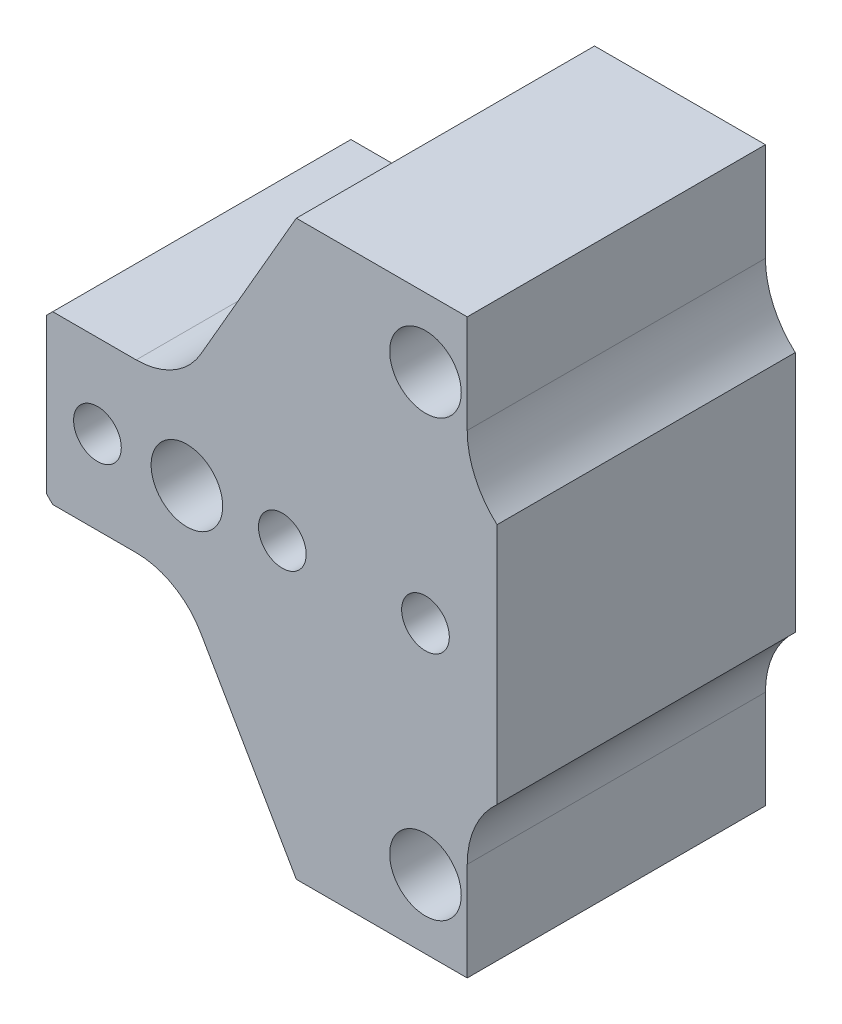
ISO-10303-21;
HEADER;
FILE_DESCRIPTION(('STEP AP214'),'2;1');
FILE_NAME('part.step','',(''),(''),'','','');
FILE_SCHEMA(('AUTOMOTIVE_DESIGN { 1 0 10303 214 1 1 1 1 }'));
ENDSEC;
DATA;
#1=APPLICATION_CONTEXT('core data for automotive mechanical design processes');
#2=APPLICATION_PROTOCOL_DEFINITION('international standard','automotive_design',2000,#1);
#3=PRODUCT_CONTEXT('',#1,'mechanical');
#4=PRODUCT('Part','Part','',(#3));
#5=PRODUCT_RELATED_PRODUCT_CATEGORY('part','',(#4));
#6=PRODUCT_DEFINITION_FORMATION('','',#4);
#7=PRODUCT_DEFINITION_CONTEXT('part definition',#1,'design');
#8=PRODUCT_DEFINITION('design','',#6,#7);
#9=PRODUCT_DEFINITION_SHAPE('','',#8);
#10=(LENGTH_UNIT() NAMED_UNIT(*) SI_UNIT(.MILLI.,.METRE.));
#11=(NAMED_UNIT(*) PLANE_ANGLE_UNIT() SI_UNIT($,.RADIAN.));
#12=(NAMED_UNIT(*) SI_UNIT($,.STERADIAN.) SOLID_ANGLE_UNIT());
#13=UNCERTAINTY_MEASURE_WITH_UNIT(LENGTH_MEASURE(1.E-05),#10,'distance_accuracy_value','');
#14=(GEOMETRIC_REPRESENTATION_CONTEXT(3) GLOBAL_UNCERTAINTY_ASSIGNED_CONTEXT((#13)) GLOBAL_UNIT_ASSIGNED_CONTEXT((#10,
#11,#12)) REPRESENTATION_CONTEXT('',''));
#15=CARTESIAN_POINT('',(0.,0.,0.));
#16=DIRECTION('',(0.,0.,1.));
#17=DIRECTION('',(1.,0.,0.));
#18=AXIS2_PLACEMENT_3D('',#15,#16,#17);
#19=CARTESIAN_POINT('',(-8.5,-26.5,50.));
#20=DIRECTION('',(0.,0.,1.));
#21=DIRECTION('',(1.,0.,0.));
#22=AXIS2_PLACEMENT_3D('',#19,#20,#21);
#23=PLANE('',#22);
#24=CARTESIAN_POINT('',(40.,36.5,50.));
#25=DIRECTION('',(0.,0.,1.));
#26=DIRECTION('',(1.,0.,0.));
#27=AXIS2_PLACEMENT_3D('',#24,#25,#26);
#28=CIRCLE('',#27,6.00000000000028);
#29=CARTESIAN_POINT('',(46.0000000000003,36.5,50.));
#30=VERTEX_POINT('',#29);
#31=EDGE_CURVE('E337',#30,#30,#28,.T.);
#32=ORIENTED_EDGE('',*,*,#31,.F.);
#33=EDGE_LOOP('',(#32));
#34=FACE_BOUND('',#33,.T.);
#35=CARTESIAN_POINT('',(-15.,0.,50.));
#36=DIRECTION('',(0.,0.,1.));
#37=DIRECTION('',(1.,0.,0.));
#38=AXIS2_PLACEMENT_3D('',#35,#36,#37);
#39=CIRCLE('',#38,4.);
#40=CARTESIAN_POINT('',(-11.,0.,50.));
#41=VERTEX_POINT('',#40);
#42=EDGE_CURVE('E349',#41,#41,#39,.T.);
#43=ORIENTED_EDGE('',*,*,#42,.F.);
#44=EDGE_LOOP('',(#43));
#45=FACE_BOUND('',#44,.T.);
#46=CARTESIAN_POINT('',(16.,0.,50.));
#47=DIRECTION('',(0.,0.,1.));
#48=DIRECTION('',(1.,0.,0.));
#49=AXIS2_PLACEMENT_3D('',#46,#47,#48);
#50=CIRCLE('',#49,4.);
#51=CARTESIAN_POINT('',(20.,0.,50.));
#52=VERTEX_POINT('',#51);
#53=EDGE_CURVE('E163',#52,#52,#50,.T.);
#54=ORIENTED_EDGE('',*,*,#53,.F.);
#55=EDGE_LOOP('',(#54));
#56=FACE_BOUND('',#55,.T.);
#57=DIRECTION('',(0.707106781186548,-0.707106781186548,0.));
#58=VECTOR('',#57,1.);
#59=CARTESIAN_POINT('',(-23.5,-13.,50.));
#60=LINE('',#59,#58);
#61=CARTESIAN_POINT('',(-23.5,-13.,50.));
#62=VERTEX_POINT('',#61);
#63=CARTESIAN_POINT('',(-22.5,-14.,50.));
#64=VERTEX_POINT('',#63);
#65=EDGE_CURVE('E190',#62,#64,#60,.T.);
#66=ORIENTED_EDGE('',*,*,#65,.T.);
#67=DIRECTION('',(1.,0.,0.));
#68=VECTOR('',#67,1.);
#69=CARTESIAN_POINT('',(-8.5,-14.,50.));
#70=LINE('',#69,#68);
#71=CARTESIAN_POINT('',(-8.5,-14.,50.));
#72=VERTEX_POINT('',#71);
#73=EDGE_CURVE('E98',#64,#72,#70,.T.);
#74=ORIENTED_EDGE('',*,*,#73,.T.);
#75=CARTESIAN_POINT('',(-8.5,-26.5,50.));
#76=DIRECTION('',(0.,0.,-1.));
#77=DIRECTION('',(1.,0.,0.));
#78=AXIS2_PLACEMENT_3D('',#75,#76,#77);
#79=CIRCLE('',#78,12.5);
#80=CARTESIAN_POINT('',(2.32531754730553,-20.25,50.));
#81=VERTEX_POINT('',#80);
#82=EDGE_CURVE('E229',#72,#81,#79,.T.);
#83=ORIENTED_EDGE('',*,*,#82,.T.);
#84=DIRECTION('',(0.5,-0.866025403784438,0.));
#85=VECTOR('',#84,1.);
#86=CARTESIAN_POINT('',(18.3467875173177,-48.,50.));
#87=LINE('',#86,#85);
#88=CARTESIAN_POINT('',(18.3467875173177,-48.,50.));
#89=VERTEX_POINT('',#88);
#90=EDGE_CURVE('E248',#81,#89,#87,.T.);
#91=ORIENTED_EDGE('',*,*,#90,.T.);
#92=DIRECTION('',(1.,0.,0.));
#93=VECTOR('',#92,1.);
#94=CARTESIAN_POINT('',(47.,-48.,50.));
#95=LINE('',#94,#93);
#96=CARTESIAN_POINT('',(47.,-48.,50.));
#97=VERTEX_POINT('',#96);
#98=EDGE_CURVE('E245',#89,#97,#95,.T.);
#99=ORIENTED_EDGE('',*,*,#98,.T.);
#100=DIRECTION('',(0.,1.,0.));
#101=VECTOR('',#100,1.);
#102=CARTESIAN_POINT('',(47.,-31.5,50.));
#103=LINE('',#102,#101);
#104=CARTESIAN_POINT('',(47.,-31.5,50.));
#105=VERTEX_POINT('',#104);
#106=EDGE_CURVE('E247',#97,#105,#103,.T.);
#107=ORIENTED_EDGE('',*,*,#106,.T.);
#108=CARTESIAN_POINT('',(62.,-31.5,50.));
#109=DIRECTION('',(0.,0.,-1.));
#110=DIRECTION('',(1.,0.,0.));
#111=AXIS2_PLACEMENT_3D('',#108,#109,#110);
#112=CIRCLE('',#111,15.);
#113=CARTESIAN_POINT('',(52.,-20.3196601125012,50.));
#114=VERTEX_POINT('',#113);
#115=EDGE_CURVE('E250',#105,#114,#112,.T.);
#116=ORIENTED_EDGE('',*,*,#115,.T.);
#117=DIRECTION('',(0.,1.,0.));
#118=VECTOR('',#117,1.);
#119=CARTESIAN_POINT('',(52.,20.3196601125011,50.));
#120=LINE('',#119,#118);
#121=CARTESIAN_POINT('',(52.,20.3196601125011,50.));
#122=VERTEX_POINT('',#121);
#123=EDGE_CURVE('E256',#114,#122,#120,.T.);
#124=ORIENTED_EDGE('',*,*,#123,.T.);
#125=CARTESIAN_POINT('',(62.,31.5,50.));
#126=DIRECTION('',(0.,0.,-1.));
#127=DIRECTION('',(1.,0.,0.));
#128=AXIS2_PLACEMENT_3D('',#125,#126,#127);
#129=CIRCLE('',#128,15.);
#130=CARTESIAN_POINT('',(47.,31.5,50.));
#131=VERTEX_POINT('',#130);
#132=EDGE_CURVE('E258',#122,#131,#129,.T.);
#133=ORIENTED_EDGE('',*,*,#132,.T.);
#134=DIRECTION('',(0.,1.,0.));
#135=VECTOR('',#134,1.);
#136=CARTESIAN_POINT('',(47.,48.,50.));
#137=LINE('',#136,#135);
#138=CARTESIAN_POINT('',(47.,48.,50.));
#139=VERTEX_POINT('',#138);
#140=EDGE_CURVE('E260',#131,#139,#137,.T.);
#141=ORIENTED_EDGE('',*,*,#140,.T.);
#142=DIRECTION('',(-1.,0.,0.));
#143=VECTOR('',#142,1.);
#144=CARTESIAN_POINT('',(18.3467875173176,48.,50.));
#145=LINE('',#144,#143);
#146=CARTESIAN_POINT('',(18.3467875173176,48.,50.));
#147=VERTEX_POINT('',#146);
#148=EDGE_CURVE('E262',#139,#147,#145,.T.);
#149=ORIENTED_EDGE('',*,*,#148,.T.);
#150=DIRECTION('',(-0.5,-0.866025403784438,0.));
#151=VECTOR('',#150,1.);
#152=CARTESIAN_POINT('',(2.32531754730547,20.25,50.));
#153=LINE('',#152,#151);
#154=CARTESIAN_POINT('',(2.32531754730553,20.25,50.));
#155=VERTEX_POINT('',#154);
#156=EDGE_CURVE('E264',#147,#155,#153,.T.);
#157=ORIENTED_EDGE('',*,*,#156,.T.);
#158=CARTESIAN_POINT('',(-8.5,26.5,50.));
#159=DIRECTION('',(0.,0.,-1.));
#160=DIRECTION('',(1.,0.,0.));
#161=AXIS2_PLACEMENT_3D('',#158,#159,#160);
#162=CIRCLE('',#161,12.5);
#163=CARTESIAN_POINT('',(-8.5,14.,50.));
#164=VERTEX_POINT('',#163);
#165=EDGE_CURVE('E141',#155,#164,#162,.T.);
#166=ORIENTED_EDGE('',*,*,#165,.T.);
#167=DIRECTION('',(-1.,0.,0.));
#168=VECTOR('',#167,1.);
#169=CARTESIAN_POINT('',(-22.5,14.,50.));
#170=LINE('',#169,#168);
#171=CARTESIAN_POINT('',(-22.5,14.,50.));
#172=VERTEX_POINT('',#171);
#173=EDGE_CURVE('E135',#164,#172,#170,.T.);
#174=ORIENTED_EDGE('',*,*,#173,.T.);
#175=DIRECTION('',(-0.707106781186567,-0.707106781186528,0.));
#176=VECTOR('',#175,1.);
#177=CARTESIAN_POINT('',(-22.5,14.,50.));
#178=LINE('',#177,#176);
#179=CARTESIAN_POINT('',(-23.5,13.,50.));
#180=VERTEX_POINT('',#179);
#181=EDGE_CURVE('E139',#172,#180,#178,.T.);
#182=ORIENTED_EDGE('',*,*,#181,.T.);
#183=DIRECTION('',(0.,-1.,0.));
#184=VECTOR('',#183,1.);
#185=CARTESIAN_POINT('',(-23.5,-13.,50.));
#186=LINE('',#185,#184);
#187=EDGE_CURVE('E31',#180,#62,#186,.T.);
#188=ORIENTED_EDGE('',*,*,#187,.T.);
#189=EDGE_LOOP('',(#66,#74,#83,#91,#99,#107,#116,#124,#133,#141,#149,#157,#166,#174,#182,#188));
#190=FACE_BOUND('',#189,.T.);
#191=CARTESIAN_POINT('',(40.,0.,50.));
#192=DIRECTION('',(0.,0.,1.));
#193=DIRECTION('',(1.,0.,0.));
#194=AXIS2_PLACEMENT_3D('',#191,#192,#193);
#195=CIRCLE('',#194,4.);
#196=CARTESIAN_POINT('',(44.,0.,50.));
#197=VERTEX_POINT('',#196);
#198=EDGE_CURVE('E355',#197,#197,#195,.T.);
#199=ORIENTED_EDGE('',*,*,#198,.F.);
#200=EDGE_LOOP('',(#199));
#201=FACE_BOUND('',#200,.T.);
#202=CARTESIAN_POINT('',(0.,0.,50.));
#203=DIRECTION('',(0.,0.,1.));
#204=DIRECTION('',(1.,0.,0.));
#205=AXIS2_PLACEMENT_3D('',#202,#203,#204);
#206=CIRCLE('',#205,6.00000000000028);
#207=CARTESIAN_POINT('',(6.00000000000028,0.,50.));
#208=VERTEX_POINT('',#207);
#209=EDGE_CURVE('E343',#208,#208,#206,.T.);
#210=ORIENTED_EDGE('',*,*,#209,.F.);
#211=EDGE_LOOP('',(#210));
#212=FACE_BOUND('',#211,.T.);
#213=CARTESIAN_POINT('',(40.,-36.5,50.));
#214=DIRECTION('',(0.,0.,1.));
#215=DIRECTION('',(1.,0.,0.));
#216=AXIS2_PLACEMENT_3D('',#213,#214,#215);
#217=CIRCLE('',#216,6.00000000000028);
#218=CARTESIAN_POINT('',(46.0000000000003,-36.5,50.));
#219=VERTEX_POINT('',#218);
#220=EDGE_CURVE('E328',#219,#219,#217,.T.);
#221=ORIENTED_EDGE('',*,*,#220,.F.);
#222=EDGE_LOOP('',(#221));
#223=FACE_BOUND('',#222,.T.);
#224=ADVANCED_FACE('F14',(#34,#45,#56,#190,#201,#212,#223),#23,.T.);
#225=CARTESIAN_POINT('',(-8.5,-26.5,0.));
#226=DIRECTION('',(0.,0.,1.));
#227=DIRECTION('',(1.,0.,0.));
#228=AXIS2_PLACEMENT_3D('',#225,#226,#227);
#229=PLANE('',#228);
#230=CARTESIAN_POINT('',(40.,36.5,0.));
#231=DIRECTION('',(0.,0.,1.));
#232=DIRECTION('',(1.,0.,0.));
#233=AXIS2_PLACEMENT_3D('',#230,#231,#232);
#234=CIRCLE('',#233,6.00000000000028);
#235=CARTESIAN_POINT('',(46.0000000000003,36.5,0.));
#236=VERTEX_POINT('',#235);
#237=EDGE_CURVE('E334',#236,#236,#234,.T.);
#238=ORIENTED_EDGE('',*,*,#237,.T.);
#239=EDGE_LOOP('',(#238));
#240=FACE_BOUND('',#239,.T.);
#241=CARTESIAN_POINT('',(-15.,0.,0.));
#242=DIRECTION('',(0.,0.,1.));
#243=DIRECTION('',(1.,0.,0.));
#244=AXIS2_PLACEMENT_3D('',#241,#242,#243);
#245=CIRCLE('',#244,4.);
#246=CARTESIAN_POINT('',(-11.,0.,0.));
#247=VERTEX_POINT('',#246);
#248=EDGE_CURVE('E346',#247,#247,#245,.T.);
#249=ORIENTED_EDGE('',*,*,#248,.T.);
#250=EDGE_LOOP('',(#249));
#251=FACE_BOUND('',#250,.T.);
#252=CARTESIAN_POINT('',(16.,0.,0.));
#253=DIRECTION('',(0.,0.,1.));
#254=DIRECTION('',(1.,0.,0.));
#255=AXIS2_PLACEMENT_3D('',#252,#253,#254);
#256=CIRCLE('',#255,4.);
#257=CARTESIAN_POINT('',(20.,0.,0.));
#258=VERTEX_POINT('',#257);
#259=EDGE_CURVE('E358',#258,#258,#256,.T.);
#260=ORIENTED_EDGE('',*,*,#259,.T.);
#261=EDGE_LOOP('',(#260));
#262=FACE_BOUND('',#261,.T.);
#263=DIRECTION('',(0.707106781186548,-0.707106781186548,0.));
#264=VECTOR('',#263,1.);
#265=CARTESIAN_POINT('',(-23.5,-13.,0.));
#266=LINE('',#265,#264);
#267=CARTESIAN_POINT('',(-23.5,-13.,0.));
#268=VERTEX_POINT('',#267);
#269=CARTESIAN_POINT('',(-22.5,-14.,0.));
#270=VERTEX_POINT('',#269);
#271=EDGE_CURVE('E159',#268,#270,#266,.T.);
#272=ORIENTED_EDGE('',*,*,#271,.F.);
#273=DIRECTION('',(0.,-1.,0.));
#274=VECTOR('',#273,1.);
#275=CARTESIAN_POINT('',(-23.5,-13.,0.));
#276=LINE('',#275,#274);
#277=CARTESIAN_POINT('',(-23.5,13.,0.));
#278=VERTEX_POINT('',#277);
#279=EDGE_CURVE('E90',#278,#268,#276,.T.);
#280=ORIENTED_EDGE('',*,*,#279,.F.);
#281=DIRECTION('',(-0.707106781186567,-0.707106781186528,0.));
#282=VECTOR('',#281,1.);
#283=CARTESIAN_POINT('',(-22.5,14.,0.));
#284=LINE('',#283,#282);
#285=CARTESIAN_POINT('',(-22.5,14.,0.));
#286=VERTEX_POINT('',#285);
#287=EDGE_CURVE('E84',#286,#278,#284,.T.);
#288=ORIENTED_EDGE('',*,*,#287,.F.);
#289=DIRECTION('',(-1.,0.,0.));
#290=VECTOR('',#289,1.);
#291=CARTESIAN_POINT('',(-22.5,14.,0.));
#292=LINE('',#291,#290);
#293=CARTESIAN_POINT('',(-8.5,14.,0.));
#294=VERTEX_POINT('',#293);
#295=EDGE_CURVE('E149',#294,#286,#292,.T.);
#296=ORIENTED_EDGE('',*,*,#295,.F.);
#297=CARTESIAN_POINT('',(-8.5,26.5,0.));
#298=DIRECTION('',(0.,0.,-1.));
#299=DIRECTION('',(1.,0.,0.));
#300=AXIS2_PLACEMENT_3D('',#297,#298,#299);
#301=CIRCLE('',#300,12.5);
#302=CARTESIAN_POINT('',(2.32531754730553,20.25,0.));
#303=VERTEX_POINT('',#302);
#304=EDGE_CURVE('E185',#303,#294,#301,.T.);
#305=ORIENTED_EDGE('',*,*,#304,.F.);
#306=DIRECTION('',(-0.5,-0.866025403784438,0.));
#307=VECTOR('',#306,1.);
#308=CARTESIAN_POINT('',(2.32531754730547,20.25,0.));
#309=LINE('',#308,#307);
#310=CARTESIAN_POINT('',(18.3467875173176,48.,0.));
#311=VERTEX_POINT('',#310);
#312=EDGE_CURVE('E183',#311,#303,#309,.T.);
#313=ORIENTED_EDGE('',*,*,#312,.F.);
#314=DIRECTION('',(-1.,0.,0.));
#315=VECTOR('',#314,1.);
#316=CARTESIAN_POINT('',(18.3467875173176,48.,0.));
#317=LINE('',#316,#315);
#318=CARTESIAN_POINT('',(47.,48.,0.));
#319=VERTEX_POINT('',#318);
#320=EDGE_CURVE('E181',#319,#311,#317,.T.);
#321=ORIENTED_EDGE('',*,*,#320,.F.);
#322=DIRECTION('',(0.,1.,0.));
#323=VECTOR('',#322,1.);
#324=CARTESIAN_POINT('',(47.,48.,0.));
#325=LINE('',#324,#323);
#326=CARTESIAN_POINT('',(47.,31.5,0.));
#327=VERTEX_POINT('',#326);
#328=EDGE_CURVE('E179',#327,#319,#325,.T.);
#329=ORIENTED_EDGE('',*,*,#328,.F.);
#330=CARTESIAN_POINT('',(62.,31.5,0.));
#331=DIRECTION('',(0.,0.,-1.));
#332=DIRECTION('',(1.,0.,0.));
#333=AXIS2_PLACEMENT_3D('',#330,#331,#332);
#334=CIRCLE('',#333,15.);
#335=CARTESIAN_POINT('',(52.,20.3196601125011,0.));
#336=VERTEX_POINT('',#335);
#337=EDGE_CURVE('E177',#336,#327,#334,.T.);
#338=ORIENTED_EDGE('',*,*,#337,.F.);
#339=DIRECTION('',(0.,1.,0.));
#340=VECTOR('',#339,1.);
#341=CARTESIAN_POINT('',(52.,20.3196601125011,0.));
#342=LINE('',#341,#340);
#343=CARTESIAN_POINT('',(52.,-20.3196601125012,0.));
#344=VERTEX_POINT('',#343);
#345=EDGE_CURVE('E175',#344,#336,#342,.T.);
#346=ORIENTED_EDGE('',*,*,#345,.F.);
#347=CARTESIAN_POINT('',(62.,-31.5,0.));
#348=DIRECTION('',(0.,0.,-1.));
#349=DIRECTION('',(1.,0.,0.));
#350=AXIS2_PLACEMENT_3D('',#347,#348,#349);
#351=CIRCLE('',#350,15.);
#352=CARTESIAN_POINT('',(47.,-31.5,0.));
#353=VERTEX_POINT('',#352);
#354=EDGE_CURVE('E173',#353,#344,#351,.T.);
#355=ORIENTED_EDGE('',*,*,#354,.F.);
#356=DIRECTION('',(0.,1.,0.));
#357=VECTOR('',#356,1.);
#358=CARTESIAN_POINT('',(47.,-31.5,0.));
#359=LINE('',#358,#357);
#360=CARTESIAN_POINT('',(47.,-48.,0.));
#361=VERTEX_POINT('',#360);
#362=EDGE_CURVE('E171',#361,#353,#359,.T.);
#363=ORIENTED_EDGE('',*,*,#362,.F.);
#364=DIRECTION('',(1.,0.,0.));
#365=VECTOR('',#364,1.);
#366=CARTESIAN_POINT('',(47.,-48.,0.));
#367=LINE('',#366,#365);
#368=CARTESIAN_POINT('',(18.3467875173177,-48.,0.));
#369=VERTEX_POINT('',#368);
#370=EDGE_CURVE('E169',#369,#361,#367,.T.);
#371=ORIENTED_EDGE('',*,*,#370,.F.);
#372=DIRECTION('',(0.5,-0.866025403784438,0.));
#373=VECTOR('',#372,1.);
#374=CARTESIAN_POINT('',(18.3467875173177,-48.,0.));
#375=LINE('',#374,#373);
#376=CARTESIAN_POINT('',(2.32531754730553,-20.25,0.));
#377=VERTEX_POINT('',#376);
#378=EDGE_CURVE('E167',#377,#369,#375,.T.);
#379=ORIENTED_EDGE('',*,*,#378,.F.);
#380=CARTESIAN_POINT('',(-8.5,-26.5,0.));
#381=DIRECTION('',(0.,0.,-1.));
#382=DIRECTION('',(1.,0.,0.));
#383=AXIS2_PLACEMENT_3D('',#380,#381,#382);
#384=CIRCLE('',#383,12.5);
#385=CARTESIAN_POINT('',(-8.5,-14.,0.));
#386=VERTEX_POINT('',#385);
#387=EDGE_CURVE('E165',#386,#377,#384,.T.);
#388=ORIENTED_EDGE('',*,*,#387,.F.);
#389=DIRECTION('',(1.,0.,0.));
#390=VECTOR('',#389,1.);
#391=CARTESIAN_POINT('',(-8.5,-14.,0.));
#392=LINE('',#391,#390);
#393=EDGE_CURVE('E162',#270,#386,#392,.T.);
#394=ORIENTED_EDGE('',*,*,#393,.F.);
#395=EDGE_LOOP('',(#272,#280,#288,#296,#305,#313,#321,#329,#338,#346,#355,#363,#371,#379,#388,#394));
#396=FACE_BOUND('',#395,.T.);
#397=CARTESIAN_POINT('',(40.,0.,0.));
#398=DIRECTION('',(0.,0.,1.));
#399=DIRECTION('',(1.,0.,0.));
#400=AXIS2_PLACEMENT_3D('',#397,#398,#399);
#401=CIRCLE('',#400,4.);
#402=CARTESIAN_POINT('',(44.,0.,0.));
#403=VERTEX_POINT('',#402);
#404=EDGE_CURVE('E352',#403,#403,#401,.T.);
#405=ORIENTED_EDGE('',*,*,#404,.T.);
#406=EDGE_LOOP('',(#405));
#407=FACE_BOUND('',#406,.T.);
#408=CARTESIAN_POINT('',(0.,0.,0.));
#409=DIRECTION('',(0.,0.,1.));
#410=DIRECTION('',(1.,0.,0.));
#411=AXIS2_PLACEMENT_3D('',#408,#409,#410);
#412=CIRCLE('',#411,6.00000000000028);
#413=CARTESIAN_POINT('',(6.00000000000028,0.,0.));
#414=VERTEX_POINT('',#413);
#415=EDGE_CURVE('E340',#414,#414,#412,.T.);
#416=ORIENTED_EDGE('',*,*,#415,.T.);
#417=EDGE_LOOP('',(#416));
#418=FACE_BOUND('',#417,.T.);
#419=CARTESIAN_POINT('',(40.,-36.5,0.));
#420=DIRECTION('',(0.,0.,1.));
#421=DIRECTION('',(1.,0.,0.));
#422=AXIS2_PLACEMENT_3D('',#419,#420,#421);
#423=CIRCLE('',#422,6.00000000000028);
#424=CARTESIAN_POINT('',(46.0000000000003,-36.5,0.));
#425=VERTEX_POINT('',#424);
#426=EDGE_CURVE('E331',#425,#425,#423,.T.);
#427=ORIENTED_EDGE('',*,*,#426,.T.);
#428=EDGE_LOOP('',(#427));
#429=FACE_BOUND('',#428,.T.);
#430=ADVANCED_FACE('F233',(#240,#251,#262,#396,#407,#418,#429),#229,.F.);
#431=CARTESIAN_POINT('',(-23.5,-13.,50.));
#432=DIRECTION('',(0.707106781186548,0.707106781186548,0.));
#433=DIRECTION('',(-0.707106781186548,0.707106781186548,0.));
#434=AXIS2_PLACEMENT_3D('',#431,#432,#433);
#435=PLANE('',#434);
#436=ORIENTED_EDGE('',*,*,#271,.T.);
#437=DIRECTION('',(0.,0.,-1.));
#438=VECTOR('',#437,1.);
#439=CARTESIAN_POINT('',(-22.5,-14.,50.));
#440=LINE('',#439,#438);
#441=EDGE_CURVE('E9',#64,#270,#440,.T.);
#442=ORIENTED_EDGE('',*,*,#441,.F.);
#443=ORIENTED_EDGE('',*,*,#65,.F.);
#444=DIRECTION('',(0.,0.,-1.));
#445=VECTOR('',#444,1.);
#446=CARTESIAN_POINT('',(-23.5,-13.,50.));
#447=LINE('',#446,#445);
#448=EDGE_CURVE('E155',#62,#268,#447,.T.);
#449=ORIENTED_EDGE('',*,*,#448,.T.);
#450=EDGE_LOOP('',(#436,#442,#443,#449));
#451=FACE_BOUND('',#450,.T.);
#452=ADVANCED_FACE('F16',(#451),#435,.F.);
#453=CARTESIAN_POINT('',(-8.5,-14.,50.));
#454=DIRECTION('',(0.,1.,0.));
#455=DIRECTION('',(0.,0.,1.));
#456=AXIS2_PLACEMENT_3D('',#453,#454,#455);
#457=PLANE('',#456);
#458=ORIENTED_EDGE('',*,*,#393,.T.);
#459=DIRECTION('',(0.,0.,-1.));
#460=VECTOR('',#459,1.);
#461=CARTESIAN_POINT('',(-8.5,-14.,50.));
#462=LINE('',#461,#460);
#463=EDGE_CURVE('E23',#72,#386,#462,.T.);
#464=ORIENTED_EDGE('',*,*,#463,.F.);
#465=ORIENTED_EDGE('',*,*,#73,.F.);
#466=ORIENTED_EDGE('',*,*,#441,.T.);
#467=EDGE_LOOP('',(#458,#464,#465,#466));
#468=FACE_BOUND('',#467,.T.);
#469=ADVANCED_FACE('F445',(#468),#457,.F.);
#470=CARTESIAN_POINT('',(-8.5,-26.5,50.));
#471=DIRECTION('',(0.,0.,-1.));
#472=DIRECTION('',(-1.,0.,0.));
#473=AXIS2_PLACEMENT_3D('',#470,#471,#472);
#474=CYLINDRICAL_SURFACE('',#473,12.5);
#475=ORIENTED_EDGE('',*,*,#387,.T.);
#476=DIRECTION('',(0.,0.,-1.));
#477=VECTOR('',#476,1.);
#478=CARTESIAN_POINT('',(2.32531754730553,-20.25,50.));
#479=LINE('',#478,#477);
#480=EDGE_CURVE('E221',#81,#377,#479,.T.);
#481=ORIENTED_EDGE('',*,*,#480,.F.);
#482=ORIENTED_EDGE('',*,*,#82,.F.);
#483=ORIENTED_EDGE('',*,*,#463,.T.);
#484=EDGE_LOOP('',(#475,#481,#482,#483));
#485=FACE_BOUND('',#484,.T.);
#486=ADVANCED_FACE('F227',(#485),#474,.F.);
#487=CARTESIAN_POINT('',(18.3467875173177,-48.,50.));
#488=DIRECTION('',(0.866025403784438,0.5,0.));
#489=DIRECTION('',(-0.5,0.866025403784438,0.));
#490=AXIS2_PLACEMENT_3D('',#487,#488,#489);
#491=PLANE('',#490);
#492=ORIENTED_EDGE('',*,*,#378,.T.);
#493=DIRECTION('',(0.,0.,-1.));
#494=VECTOR('',#493,1.);
#495=CARTESIAN_POINT('',(18.3467875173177,-48.,50.));
#496=LINE('',#495,#494);
#497=EDGE_CURVE('E218',#89,#369,#496,.T.);
#498=ORIENTED_EDGE('',*,*,#497,.F.);
#499=ORIENTED_EDGE('',*,*,#90,.F.);
#500=ORIENTED_EDGE('',*,*,#480,.T.);
#501=EDGE_LOOP('',(#492,#498,#499,#500));
#502=FACE_BOUND('',#501,.T.);
#503=ADVANCED_FACE('F239',(#502),#491,.F.);
#504=CARTESIAN_POINT('',(47.,-48.,50.));
#505=DIRECTION('',(0.,1.,0.));
#506=DIRECTION('',(0.,0.,1.));
#507=AXIS2_PLACEMENT_3D('',#504,#505,#506);
#508=PLANE('',#507);
#509=ORIENTED_EDGE('',*,*,#370,.T.);
#510=DIRECTION('',(0.,0.,-1.));
#511=VECTOR('',#510,1.);
#512=CARTESIAN_POINT('',(47.,-48.,50.));
#513=LINE('',#512,#511);
#514=EDGE_CURVE('E215',#97,#361,#513,.T.);
#515=ORIENTED_EDGE('',*,*,#514,.F.);
#516=ORIENTED_EDGE('',*,*,#98,.F.);
#517=ORIENTED_EDGE('',*,*,#497,.T.);
#518=EDGE_LOOP('',(#509,#515,#516,#517));
#519=FACE_BOUND('',#518,.T.);
#520=ADVANCED_FACE('F243',(#519),#508,.F.);
#521=CARTESIAN_POINT('',(47.,-31.5,50.));
#522=DIRECTION('',(-1.,0.,0.));
#523=DIRECTION('',(0.,0.,1.));
#524=AXIS2_PLACEMENT_3D('',#521,#522,#523);
#525=PLANE('',#524);
#526=ORIENTED_EDGE('',*,*,#362,.T.);
#527=DIRECTION('',(0.,0.,-1.));
#528=VECTOR('',#527,1.);
#529=CARTESIAN_POINT('',(47.,-31.5,50.));
#530=LINE('',#529,#528);
#531=EDGE_CURVE('E212',#105,#353,#530,.T.);
#532=ORIENTED_EDGE('',*,*,#531,.F.);
#533=ORIENTED_EDGE('',*,*,#106,.F.);
#534=ORIENTED_EDGE('',*,*,#514,.T.);
#535=EDGE_LOOP('',(#526,#532,#533,#534));
#536=FACE_BOUND('',#535,.T.);
#537=ADVANCED_FACE('F471',(#536),#525,.F.);
#538=CARTESIAN_POINT('',(62.,-31.5,50.));
#539=DIRECTION('',(0.,0.,-1.));
#540=DIRECTION('',(-1.,0.,0.));
#541=AXIS2_PLACEMENT_3D('',#538,#539,#540);
#542=CYLINDRICAL_SURFACE('',#541,15.);
#543=ORIENTED_EDGE('',*,*,#354,.T.);
#544=DIRECTION('',(0.,0.,-1.));
#545=VECTOR('',#544,1.);
#546=CARTESIAN_POINT('',(52.,-20.3196601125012,50.));
#547=LINE('',#546,#545);
#548=EDGE_CURVE('E209',#114,#344,#547,.T.);
#549=ORIENTED_EDGE('',*,*,#548,.F.);
#550=ORIENTED_EDGE('',*,*,#115,.F.);
#551=ORIENTED_EDGE('',*,*,#531,.T.);
#552=EDGE_LOOP('',(#543,#549,#550,#551));
#553=FACE_BOUND('',#552,.T.);
#554=ADVANCED_FACE('F479',(#553),#542,.F.);
#555=CARTESIAN_POINT('',(52.,20.3196601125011,50.));
#556=DIRECTION('',(-1.,0.,0.));
#557=DIRECTION('',(0.,-1.,0.));
#558=AXIS2_PLACEMENT_3D('',#555,#556,#557);
#559=PLANE('',#558);
#560=ORIENTED_EDGE('',*,*,#345,.T.);
#561=DIRECTION('',(0.,0.,-1.));
#562=VECTOR('',#561,1.);
#563=CARTESIAN_POINT('',(52.,20.3196601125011,50.));
#564=LINE('',#563,#562);
#565=EDGE_CURVE('E206',#122,#336,#564,.T.);
#566=ORIENTED_EDGE('',*,*,#565,.F.);
#567=ORIENTED_EDGE('',*,*,#123,.F.);
#568=ORIENTED_EDGE('',*,*,#548,.T.);
#569=EDGE_LOOP('',(#560,#566,#567,#568));
#570=FACE_BOUND('',#569,.T.);
#571=ADVANCED_FACE('F488',(#570),#559,.F.);
#572=CARTESIAN_POINT('',(62.,31.5,50.));
#573=DIRECTION('',(0.,0.,-1.));
#574=DIRECTION('',(-1.,0.,0.));
#575=AXIS2_PLACEMENT_3D('',#572,#573,#574);
#576=CYLINDRICAL_SURFACE('',#575,15.);
#577=ORIENTED_EDGE('',*,*,#337,.T.);
#578=DIRECTION('',(0.,0.,-1.));
#579=VECTOR('',#578,1.);
#580=CARTESIAN_POINT('',(47.,31.5,50.));
#581=LINE('',#580,#579);
#582=EDGE_CURVE('E203',#131,#327,#581,.T.);
#583=ORIENTED_EDGE('',*,*,#582,.F.);
#584=ORIENTED_EDGE('',*,*,#132,.F.);
#585=ORIENTED_EDGE('',*,*,#565,.T.);
#586=EDGE_LOOP('',(#577,#583,#584,#585));
#587=FACE_BOUND('',#586,.T.);
#588=ADVANCED_FACE('F497',(#587),#576,.F.);
#589=CARTESIAN_POINT('',(47.,48.,50.));
#590=DIRECTION('',(-1.,0.,0.));
#591=DIRECTION('',(0.,0.,1.));
#592=AXIS2_PLACEMENT_3D('',#589,#590,#591);
#593=PLANE('',#592);
#594=ORIENTED_EDGE('',*,*,#328,.T.);
#595=DIRECTION('',(0.,0.,-1.));
#596=VECTOR('',#595,1.);
#597=CARTESIAN_POINT('',(47.,48.,50.));
#598=LINE('',#597,#596);
#599=EDGE_CURVE('E200',#139,#319,#598,.T.);
#600=ORIENTED_EDGE('',*,*,#599,.F.);
#601=ORIENTED_EDGE('',*,*,#140,.F.);
#602=ORIENTED_EDGE('',*,*,#582,.T.);
#603=EDGE_LOOP('',(#594,#600,#601,#602));
#604=FACE_BOUND('',#603,.T.);
#605=ADVANCED_FACE('F506',(#604),#593,.F.);
#606=CARTESIAN_POINT('',(18.3467875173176,48.,50.));
#607=DIRECTION('',(0.,-1.,0.));
#608=DIRECTION('',(0.,0.,-1.));
#609=AXIS2_PLACEMENT_3D('',#606,#607,#608);
#610=PLANE('',#609);
#611=ORIENTED_EDGE('',*,*,#320,.T.);
#612=DIRECTION('',(0.,0.,-1.));
#613=VECTOR('',#612,1.);
#614=CARTESIAN_POINT('',(18.3467875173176,48.,50.));
#615=LINE('',#614,#613);
#616=EDGE_CURVE('E197',#147,#311,#615,.T.);
#617=ORIENTED_EDGE('',*,*,#616,.F.);
#618=ORIENTED_EDGE('',*,*,#148,.F.);
#619=ORIENTED_EDGE('',*,*,#599,.T.);
#620=EDGE_LOOP('',(#611,#617,#618,#619));
#621=FACE_BOUND('',#620,.T.);
#622=ADVANCED_FACE('F515',(#621),#610,.F.);
#623=CARTESIAN_POINT('',(2.32531754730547,20.25,50.));
#624=DIRECTION('',(0.866025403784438,-0.5,0.));
#625=DIRECTION('',(0.5,0.866025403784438,0.));
#626=AXIS2_PLACEMENT_3D('',#623,#624,#625);
#627=PLANE('',#626);
#628=ORIENTED_EDGE('',*,*,#312,.T.);
#629=DIRECTION('',(0.,0.,-1.));
#630=VECTOR('',#629,1.);
#631=CARTESIAN_POINT('',(2.32531754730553,20.25,50.));
#632=LINE('',#631,#630);
#633=EDGE_CURVE('E194',#155,#303,#632,.T.);
#634=ORIENTED_EDGE('',*,*,#633,.F.);
#635=ORIENTED_EDGE('',*,*,#156,.F.);
#636=ORIENTED_EDGE('',*,*,#616,.T.);
#637=EDGE_LOOP('',(#628,#634,#635,#636));
#638=FACE_BOUND('',#637,.T.);
#639=ADVANCED_FACE('F270',(#638),#627,.F.);
#640=CARTESIAN_POINT('',(-8.5,26.5,50.));
#641=DIRECTION('',(0.,0.,-1.));
#642=DIRECTION('',(-1.,0.,0.));
#643=AXIS2_PLACEMENT_3D('',#640,#641,#642);
#644=CYLINDRICAL_SURFACE('',#643,12.5);
#645=ORIENTED_EDGE('',*,*,#304,.T.);
#646=DIRECTION('',(0.,0.,-1.));
#647=VECTOR('',#646,1.);
#648=CARTESIAN_POINT('',(-8.5,14.,50.));
#649=LINE('',#648,#647);
#650=EDGE_CURVE('E150',#164,#294,#649,.T.);
#651=ORIENTED_EDGE('',*,*,#650,.F.);
#652=ORIENTED_EDGE('',*,*,#165,.F.);
#653=ORIENTED_EDGE('',*,*,#633,.T.);
#654=EDGE_LOOP('',(#645,#651,#652,#653));
#655=FACE_BOUND('',#654,.T.);
#656=ADVANCED_FACE('F274',(#655),#644,.F.);
#657=CARTESIAN_POINT('',(-22.5,14.,50.));
#658=DIRECTION('',(0.,-1.,0.));
#659=DIRECTION('',(1.,0.,0.));
#660=AXIS2_PLACEMENT_3D('',#657,#658,#659);
#661=PLANE('',#660);
#662=ORIENTED_EDGE('',*,*,#295,.T.);
#663=DIRECTION('',(0.,0.,-1.));
#664=VECTOR('',#663,1.);
#665=CARTESIAN_POINT('',(-22.5,14.,50.));
#666=LINE('',#665,#664);
#667=EDGE_CURVE('E146',#172,#286,#666,.T.);
#668=ORIENTED_EDGE('',*,*,#667,.F.);
#669=ORIENTED_EDGE('',*,*,#173,.F.);
#670=ORIENTED_EDGE('',*,*,#650,.T.);
#671=EDGE_LOOP('',(#662,#668,#669,#670));
#672=FACE_BOUND('',#671,.T.);
#673=ADVANCED_FACE('F147',(#672),#661,.F.);
#674=CARTESIAN_POINT('',(-22.5,14.,50.));
#675=DIRECTION('',(0.707106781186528,-0.707106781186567,0.));
#676=DIRECTION('',(0.707106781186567,0.707106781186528,0.));
#677=AXIS2_PLACEMENT_3D('',#674,#675,#676);
#678=PLANE('',#677);
#679=ORIENTED_EDGE('',*,*,#287,.T.);
#680=DIRECTION('',(0.,0.,-1.));
#681=VECTOR('',#680,1.);
#682=CARTESIAN_POINT('',(-23.5,13.,50.));
#683=LINE('',#682,#681);
#684=EDGE_CURVE('E151',#180,#278,#683,.T.);
#685=ORIENTED_EDGE('',*,*,#684,.F.);
#686=ORIENTED_EDGE('',*,*,#181,.F.);
#687=ORIENTED_EDGE('',*,*,#667,.T.);
#688=EDGE_LOOP('',(#679,#685,#686,#687));
#689=FACE_BOUND('',#688,.T.);
#690=ADVANCED_FACE('F153',(#689),#678,.F.);
#691=CARTESIAN_POINT('',(-23.5,-13.,50.));
#692=DIRECTION('',(1.,0.,0.));
#693=DIRECTION('',(0.,0.,-1.));
#694=AXIS2_PLACEMENT_3D('',#691,#692,#693);
#695=PLANE('',#694);
#696=ORIENTED_EDGE('',*,*,#279,.T.);
#697=ORIENTED_EDGE('',*,*,#448,.F.);
#698=ORIENTED_EDGE('',*,*,#187,.F.);
#699=ORIENTED_EDGE('',*,*,#684,.T.);
#700=EDGE_LOOP('',(#696,#697,#698,#699));
#701=FACE_BOUND('',#700,.T.);
#702=ADVANCED_FACE('F278',(#701),#695,.F.);
#703=CARTESIAN_POINT('',(16.,0.,50.));
#704=DIRECTION('',(0.,0.,-1.));
#705=DIRECTION('',(-1.,0.,0.));
#706=AXIS2_PLACEMENT_3D('',#703,#704,#705);
#707=CYLINDRICAL_SURFACE('',#706,4.);
#708=ORIENTED_EDGE('',*,*,#53,.T.);
#709=EDGE_LOOP('',(#708));
#710=FACE_BOUND('',#709,.T.);
#711=ORIENTED_EDGE('',*,*,#259,.F.);
#712=EDGE_LOOP('',(#711));
#713=FACE_BOUND('',#712,.T.);
#714=ADVANCED_FACE('F280',(#710,#713),#707,.F.);
#715=CARTESIAN_POINT('',(40.,0.,50.));
#716=DIRECTION('',(0.,0.,-1.));
#717=DIRECTION('',(-1.,0.,0.));
#718=AXIS2_PLACEMENT_3D('',#715,#716,#717);
#719=CYLINDRICAL_SURFACE('',#718,4.);
#720=ORIENTED_EDGE('',*,*,#198,.T.);
#721=EDGE_LOOP('',(#720));
#722=FACE_BOUND('',#721,.T.);
#723=ORIENTED_EDGE('',*,*,#404,.F.);
#724=EDGE_LOOP('',(#723));
#725=FACE_BOUND('',#724,.T.);
#726=ADVANCED_FACE('F288',(#722,#725),#719,.F.);
#727=CARTESIAN_POINT('',(-15.,0.,50.));
#728=DIRECTION('',(0.,0.,-1.));
#729=DIRECTION('',(-1.,0.,0.));
#730=AXIS2_PLACEMENT_3D('',#727,#728,#729);
#731=CYLINDRICAL_SURFACE('',#730,4.);
#732=ORIENTED_EDGE('',*,*,#42,.T.);
#733=EDGE_LOOP('',(#732));
#734=FACE_BOUND('',#733,.T.);
#735=ORIENTED_EDGE('',*,*,#248,.F.);
#736=EDGE_LOOP('',(#735));
#737=FACE_BOUND('',#736,.T.);
#738=ADVANCED_FACE('F306',(#734,#737),#731,.F.);
#739=CARTESIAN_POINT('',(0.,0.,50.));
#740=DIRECTION('',(0.,0.,-1.));
#741=DIRECTION('',(-1.,0.,0.));
#742=AXIS2_PLACEMENT_3D('',#739,#740,#741);
#743=CYLINDRICAL_SURFACE('',#742,6.00000000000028);
#744=ORIENTED_EDGE('',*,*,#209,.T.);
#745=EDGE_LOOP('',(#744));
#746=FACE_BOUND('',#745,.T.);
#747=ORIENTED_EDGE('',*,*,#415,.F.);
#748=EDGE_LOOP('',(#747));
#749=FACE_BOUND('',#748,.T.);
#750=ADVANCED_FACE('F310',(#746,#749),#743,.F.);
#751=CARTESIAN_POINT('',(40.,36.5,50.));
#752=DIRECTION('',(0.,0.,-1.));
#753=DIRECTION('',(-1.,0.,0.));
#754=AXIS2_PLACEMENT_3D('',#751,#752,#753);
#755=CYLINDRICAL_SURFACE('',#754,6.00000000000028);
#756=ORIENTED_EDGE('',*,*,#31,.T.);
#757=EDGE_LOOP('',(#756));
#758=FACE_BOUND('',#757,.T.);
#759=ORIENTED_EDGE('',*,*,#237,.F.);
#760=EDGE_LOOP('',(#759));
#761=FACE_BOUND('',#760,.T.);
#762=ADVANCED_FACE('F314',(#758,#761),#755,.F.);
#763=CARTESIAN_POINT('',(40.,-36.5,50.));
#764=DIRECTION('',(0.,0.,-1.));
#765=DIRECTION('',(-1.,0.,0.));
#766=AXIS2_PLACEMENT_3D('',#763,#764,#765);
#767=CYLINDRICAL_SURFACE('',#766,6.00000000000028);
#768=ORIENTED_EDGE('',*,*,#220,.T.);
#769=EDGE_LOOP('',(#768));
#770=FACE_BOUND('',#769,.T.);
#771=ORIENTED_EDGE('',*,*,#426,.F.);
#772=EDGE_LOOP('',(#771));
#773=FACE_BOUND('',#772,.T.);
#774=ADVANCED_FACE('F318',(#770,#773),#767,.F.);
#775=CLOSED_SHELL('',(#224,#430,#452,#469,#486,#503,#520,#537,#554,#571,#588,#605,#622,#639,
#656,#673,#690,#702,#714,#726,#738,#750,#762,#774));
#776=MANIFOLD_SOLID_BREP('B1',#775);
#777=ADVANCED_BREP_SHAPE_REPRESENTATION('',(#18,#776),#14);
#778=SHAPE_DEFINITION_REPRESENTATION(#9,#777);
ENDSEC;
END-ISO-10303-21;
